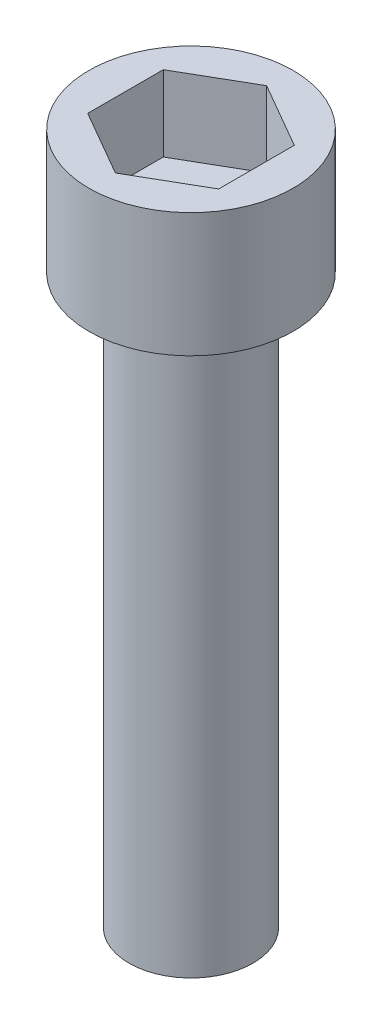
ISO-10303-21;
HEADER;
FILE_DESCRIPTION(('STEP AP214'),'2;1');
FILE_NAME('part.step','',(''),(''),'','','');
FILE_SCHEMA(('AUTOMOTIVE_DESIGN { 1 0 10303 214 1 1 1 1 }'));
ENDSEC;
DATA;
#1=APPLICATION_CONTEXT('core data for automotive mechanical design processes');
#2=APPLICATION_PROTOCOL_DEFINITION('international standard','automotive_design',2000,#1);
#3=PRODUCT_CONTEXT('',#1,'mechanical');
#4=PRODUCT('Part','Part','',(#3));
#5=PRODUCT_RELATED_PRODUCT_CATEGORY('part','',(#4));
#6=PRODUCT_DEFINITION_FORMATION('','',#4);
#7=PRODUCT_DEFINITION_CONTEXT('part definition',#1,'design');
#8=PRODUCT_DEFINITION('design','',#6,#7);
#9=PRODUCT_DEFINITION_SHAPE('','',#8);
#10=(LENGTH_UNIT() NAMED_UNIT(*) SI_UNIT(.MILLI.,.METRE.));
#11=(NAMED_UNIT(*) PLANE_ANGLE_UNIT() SI_UNIT($,.RADIAN.));
#12=(NAMED_UNIT(*) SI_UNIT($,.STERADIAN.) SOLID_ANGLE_UNIT());
#13=UNCERTAINTY_MEASURE_WITH_UNIT(LENGTH_MEASURE(1.E-05),#10,'distance_accuracy_value','');
#14=(GEOMETRIC_REPRESENTATION_CONTEXT(3) GLOBAL_UNCERTAINTY_ASSIGNED_CONTEXT((#13)) GLOBAL_UNIT_ASSIGNED_CONTEXT((#10,
#11,#12)) REPRESENTATION_CONTEXT('',''));
#15=CARTESIAN_POINT('',(0.,0.,0.));
#16=DIRECTION('',(0.,0.,1.));
#17=DIRECTION('',(1.,0.,0.));
#18=AXIS2_PLACEMENT_3D('',#15,#16,#17);
#19=CARTESIAN_POINT('',(-2.08279999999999,-23.2156,0.));
#20=DIRECTION('',(0.,-1.,0.));
#21=DIRECTION('',(0.,0.,-1.));
#22=AXIS2_PLACEMENT_3D('',#19,#20,#21);
#23=PLANE('',#22);
#24=CARTESIAN_POINT('',(0.,-23.2156,0.));
#25=DIRECTION('',(0.,1.,0.));
#26=DIRECTION('',(0.,0.,1.));
#27=AXIS2_PLACEMENT_3D('',#24,#25,#26);
#28=CIRCLE('',#27,2.08279999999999);
#29=CARTESIAN_POINT('',(0.,-23.2156,2.08279999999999));
#30=VERTEX_POINT('',#29);
#31=EDGE_CURVE('E11',#30,#30,#28,.T.);
#32=ORIENTED_EDGE('',*,*,#31,.F.);
#33=EDGE_LOOP('',(#32));
#34=FACE_BOUND('',#33,.T.);
#35=ADVANCED_FACE('F32',(#34),#23,.T.);
#36=CARTESIAN_POINT('',(0.,66.04,0.));
#37=DIRECTION('',(0.,1.,0.));
#38=DIRECTION('',(0.,0.,1.));
#39=AXIS2_PLACEMENT_3D('',#36,#37,#38);
#40=CYLINDRICAL_SURFACE('',#39,2.08279999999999);
#41=ORIENTED_EDGE('',*,*,#31,.T.);
#42=EDGE_LOOP('',(#41));
#43=FACE_BOUND('',#42,.T.);
#44=CARTESIAN_POINT('',(0.,-4.1656,0.));
#45=DIRECTION('',(0.,1.,0.));
#46=DIRECTION('',(0.,0.,1.));
#47=AXIS2_PLACEMENT_3D('',#44,#45,#46);
#48=CIRCLE('',#47,2.08279999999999);
#49=CARTESIAN_POINT('',(0.,-4.1656,2.08279999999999));
#50=VERTEX_POINT('',#49);
#51=EDGE_CURVE('E39',#50,#50,#48,.T.);
#52=ORIENTED_EDGE('',*,*,#51,.F.);
#53=EDGE_LOOP('',(#52));
#54=FACE_BOUND('',#53,.T.);
#55=ADVANCED_FACE('F151',(#43,#54),#40,.T.);
#56=CARTESIAN_POINT('',(-3.42899999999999,-4.1656,0.));
#57=DIRECTION('',(0.,-1.,0.));
#58=DIRECTION('',(0.,0.,-1.));
#59=AXIS2_PLACEMENT_3D('',#56,#57,#58);
#60=PLANE('',#59);
#61=ORIENTED_EDGE('',*,*,#51,.T.);
#62=EDGE_LOOP('',(#61));
#63=FACE_BOUND('',#62,.T.);
#64=CARTESIAN_POINT('',(0.,-4.1656,0.));
#65=DIRECTION('',(0.,1.,0.));
#66=DIRECTION('',(0.,0.,1.));
#67=AXIS2_PLACEMENT_3D('',#64,#65,#66);
#68=CIRCLE('',#67,3.42899999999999);
#69=CARTESIAN_POINT('',(0.,-4.1656,3.42899999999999));
#70=VERTEX_POINT('',#69);
#71=EDGE_CURVE('E143',#70,#70,#68,.T.);
#72=ORIENTED_EDGE('',*,*,#71,.F.);
#73=EDGE_LOOP('',(#72));
#74=FACE_BOUND('',#73,.T.);
#75=ADVANCED_FACE('F148',(#63,#74),#60,.T.);
#76=CARTESIAN_POINT('',(0.,66.04,0.));
#77=DIRECTION('',(0.,1.,0.));
#78=DIRECTION('',(0.,0.,1.));
#79=AXIS2_PLACEMENT_3D('',#76,#77,#78);
#80=CYLINDRICAL_SURFACE('',#79,3.42899999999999);
#81=ORIENTED_EDGE('',*,*,#71,.T.);
#82=EDGE_LOOP('',(#81));
#83=FACE_BOUND('',#82,.T.);
#84=CARTESIAN_POINT('',(0.,0.,0.));
#85=DIRECTION('',(0.,1.,0.));
#86=DIRECTION('',(0.,0.,1.));
#87=AXIS2_PLACEMENT_3D('',#84,#85,#86);
#88=CIRCLE('',#87,3.42899999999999);
#89=CARTESIAN_POINT('',(0.,0.,3.42899999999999));
#90=VERTEX_POINT('',#89);
#91=EDGE_CURVE('E134',#90,#90,#88,.T.);
#92=ORIENTED_EDGE('',*,*,#91,.F.);
#93=EDGE_LOOP('',(#92));
#94=FACE_BOUND('',#93,.T.);
#95=ADVANCED_FACE('F158',(#83,#94),#80,.T.);
#96=CARTESIAN_POINT('',(0.,0.,0.));
#97=DIRECTION('',(0.,1.,0.));
#98=DIRECTION('',(0.,0.,1.));
#99=AXIS2_PLACEMENT_3D('',#96,#97,#98);
#100=PLANE('',#99);
#101=DIRECTION('',(-0.866025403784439,0.,-0.5));
#102=VECTOR('',#101,1.);
#103=CARTESIAN_POINT('',(2.19970452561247,0.,-1.27));
#104=LINE('',#103,#102);
#105=CARTESIAN_POINT('',(2.19970452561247,0.,-1.27));
#106=VERTEX_POINT('',#105);
#107=CARTESIAN_POINT('',(0.,0.,-2.54));
#108=VERTEX_POINT('',#107);
#109=EDGE_CURVE('E46',#106,#108,#104,.T.);
#110=ORIENTED_EDGE('',*,*,#109,.F.);
#111=DIRECTION('',(0.,0.,-1.));
#112=VECTOR('',#111,1.);
#113=CARTESIAN_POINT('',(2.19970452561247,0.,1.27));
#114=LINE('',#113,#112);
#115=CARTESIAN_POINT('',(2.19970452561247,0.,1.27));
#116=VERTEX_POINT('',#115);
#117=EDGE_CURVE('E116',#116,#106,#114,.T.);
#118=ORIENTED_EDGE('',*,*,#117,.F.);
#119=DIRECTION('',(0.866025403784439,0.,-0.5));
#120=VECTOR('',#119,1.);
#121=CARTESIAN_POINT('',(0.,0.,2.54));
#122=LINE('',#121,#120);
#123=CARTESIAN_POINT('',(0.,0.,2.54));
#124=VERTEX_POINT('',#123);
#125=EDGE_CURVE('E110',#124,#116,#122,.T.);
#126=ORIENTED_EDGE('',*,*,#125,.F.);
#127=DIRECTION('',(0.866025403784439,0.,0.5));
#128=VECTOR('',#127,1.);
#129=CARTESIAN_POINT('',(-2.19970452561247,0.,1.27));
#130=LINE('',#129,#128);
#131=CARTESIAN_POINT('',(-2.19970452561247,0.,1.27));
#132=VERTEX_POINT('',#131);
#133=EDGE_CURVE('E108',#132,#124,#130,.T.);
#134=ORIENTED_EDGE('',*,*,#133,.F.);
#135=DIRECTION('',(0.,0.,1.));
#136=VECTOR('',#135,1.);
#137=CARTESIAN_POINT('',(-2.19970452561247,0.,-1.27));
#138=LINE('',#137,#136);
#139=CARTESIAN_POINT('',(-2.19970452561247,0.,-1.27));
#140=VERTEX_POINT('',#139);
#141=EDGE_CURVE('E89',#140,#132,#138,.T.);
#142=ORIENTED_EDGE('',*,*,#141,.F.);
#143=DIRECTION('',(-0.866025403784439,0.,0.5));
#144=VECTOR('',#143,1.);
#145=CARTESIAN_POINT('',(0.,0.,-2.54));
#146=LINE('',#145,#144);
#147=EDGE_CURVE('E100',#108,#140,#146,.T.);
#148=ORIENTED_EDGE('',*,*,#147,.F.);
#149=EDGE_LOOP('',(#110,#118,#126,#134,#142,#148));
#150=FACE_BOUND('',#149,.T.);
#151=ORIENTED_EDGE('',*,*,#91,.T.);
#152=EDGE_LOOP('',(#151));
#153=FACE_BOUND('',#152,.T.);
#154=ADVANCED_FACE('F104',(#150,#153),#100,.T.);
#155=CARTESIAN_POINT('',(2.19970452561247,-2.54,-1.27));
#156=DIRECTION('',(0.5,0.,-0.866025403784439));
#157=DIRECTION('',(-0.866025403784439,0.,-0.5));
#158=AXIS2_PLACEMENT_3D('',#155,#156,#157);
#159=PLANE('',#158);
#160=ORIENTED_EDGE('',*,*,#109,.T.);
#161=DIRECTION('',(0.,1.,0.));
#162=VECTOR('',#161,1.);
#163=CARTESIAN_POINT('',(0.,-2.54,-2.54));
#164=LINE('',#163,#162);
#165=CARTESIAN_POINT('',(0.,-2.54,-2.54));
#166=VERTEX_POINT('',#165);
#167=EDGE_CURVE('E97',#166,#108,#164,.T.);
#168=ORIENTED_EDGE('',*,*,#167,.F.);
#169=DIRECTION('',(-0.866025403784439,0.,-0.5));
#170=VECTOR('',#169,1.);
#171=CARTESIAN_POINT('',(2.19970452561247,-2.54,-1.27));
#172=LINE('',#171,#170);
#173=CARTESIAN_POINT('',(2.19970452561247,-2.54,-1.27));
#174=VERTEX_POINT('',#173);
#175=EDGE_CURVE('E118',#174,#166,#172,.T.);
#176=ORIENTED_EDGE('',*,*,#175,.F.);
#177=DIRECTION('',(0.,1.,0.));
#178=VECTOR('',#177,1.);
#179=CARTESIAN_POINT('',(2.19970452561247,-2.54,-1.27));
#180=LINE('',#179,#178);
#181=EDGE_CURVE('E53',#174,#106,#180,.T.);
#182=ORIENTED_EDGE('',*,*,#181,.T.);
#183=EDGE_LOOP('',(#160,#168,#176,#182));
#184=FACE_BOUND('',#183,.T.);
#185=ADVANCED_FACE('F167',(#184),#159,.F.);
#186=CARTESIAN_POINT('',(2.19970452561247,-2.54,1.27));
#187=DIRECTION('',(1.,0.,0.));
#188=DIRECTION('',(0.,0.,-1.));
#189=AXIS2_PLACEMENT_3D('',#186,#187,#188);
#190=PLANE('',#189);
#191=ORIENTED_EDGE('',*,*,#117,.T.);
#192=ORIENTED_EDGE('',*,*,#181,.F.);
#193=DIRECTION('',(0.,0.,-1.));
#194=VECTOR('',#193,1.);
#195=CARTESIAN_POINT('',(2.19970452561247,-2.54,1.27));
#196=LINE('',#195,#194);
#197=CARTESIAN_POINT('',(2.19970452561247,-2.54,1.27));
#198=VERTEX_POINT('',#197);
#199=EDGE_CURVE('E130',#198,#174,#196,.T.);
#200=ORIENTED_EDGE('',*,*,#199,.F.);
#201=DIRECTION('',(0.,1.,0.));
#202=VECTOR('',#201,1.);
#203=CARTESIAN_POINT('',(2.19970452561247,-2.54,1.27));
#204=LINE('',#203,#202);
#205=EDGE_CURVE('E135',#198,#116,#204,.T.);
#206=ORIENTED_EDGE('',*,*,#205,.T.);
#207=EDGE_LOOP('',(#191,#192,#200,#206));
#208=FACE_BOUND('',#207,.T.);
#209=ADVANCED_FACE('F170',(#208),#190,.F.);
#210=CARTESIAN_POINT('',(0.,-2.54,2.54));
#211=DIRECTION('',(0.5,0.,0.866025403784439));
#212=DIRECTION('',(0.866025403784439,0.,-0.5));
#213=AXIS2_PLACEMENT_3D('',#210,#211,#212);
#214=PLANE('',#213);
#215=ORIENTED_EDGE('',*,*,#125,.T.);
#216=ORIENTED_EDGE('',*,*,#205,.F.);
#217=DIRECTION('',(0.866025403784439,0.,-0.5));
#218=VECTOR('',#217,1.);
#219=CARTESIAN_POINT('',(0.,-2.54,2.54));
#220=LINE('',#219,#218);
#221=CARTESIAN_POINT('',(0.,-2.54,2.54));
#222=VERTEX_POINT('',#221);
#223=EDGE_CURVE('E127',#222,#198,#220,.T.);
#224=ORIENTED_EDGE('',*,*,#223,.F.);
#225=DIRECTION('',(0.,1.,0.));
#226=VECTOR('',#225,1.);
#227=CARTESIAN_POINT('',(0.,-2.54,2.54));
#228=LINE('',#227,#226);
#229=EDGE_CURVE('E137',#222,#124,#228,.T.);
#230=ORIENTED_EDGE('',*,*,#229,.T.);
#231=EDGE_LOOP('',(#215,#216,#224,#230));
#232=FACE_BOUND('',#231,.T.);
#233=ADVANCED_FACE('F179',(#232),#214,.F.);
#234=CARTESIAN_POINT('',(-2.19970452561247,-2.54,1.27));
#235=DIRECTION('',(-0.5,0.,0.866025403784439));
#236=DIRECTION('',(0.866025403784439,0.,0.5));
#237=AXIS2_PLACEMENT_3D('',#234,#235,#236);
#238=PLANE('',#237);
#239=ORIENTED_EDGE('',*,*,#133,.T.);
#240=ORIENTED_EDGE('',*,*,#229,.F.);
#241=DIRECTION('',(0.866025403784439,0.,0.5));
#242=VECTOR('',#241,1.);
#243=CARTESIAN_POINT('',(-2.19970452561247,-2.54,1.27));
#244=LINE('',#243,#242);
#245=CARTESIAN_POINT('',(-2.19970452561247,-2.54,1.27));
#246=VERTEX_POINT('',#245);
#247=EDGE_CURVE('E124',#246,#222,#244,.T.);
#248=ORIENTED_EDGE('',*,*,#247,.F.);
#249=DIRECTION('',(0.,1.,0.));
#250=VECTOR('',#249,1.);
#251=CARTESIAN_POINT('',(-2.19970452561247,-2.54,1.27));
#252=LINE('',#251,#250);
#253=EDGE_CURVE('E96',#246,#132,#252,.T.);
#254=ORIENTED_EDGE('',*,*,#253,.T.);
#255=EDGE_LOOP('',(#239,#240,#248,#254));
#256=FACE_BOUND('',#255,.T.);
#257=ADVANCED_FACE('F176',(#256),#238,.F.);
#258=CARTESIAN_POINT('',(-2.19970452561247,-2.54,-1.27));
#259=DIRECTION('',(-1.,0.,0.));
#260=DIRECTION('',(0.,0.,1.));
#261=AXIS2_PLACEMENT_3D('',#258,#259,#260);
#262=PLANE('',#261);
#263=ORIENTED_EDGE('',*,*,#141,.T.);
#264=ORIENTED_EDGE('',*,*,#253,.F.);
#265=DIRECTION('',(0.,0.,1.));
#266=VECTOR('',#265,1.);
#267=CARTESIAN_POINT('',(-2.19970452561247,-2.54,-1.27));
#268=LINE('',#267,#266);
#269=CARTESIAN_POINT('',(-2.19970452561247,-2.54,-1.27));
#270=VERTEX_POINT('',#269);
#271=EDGE_CURVE('E92',#270,#246,#268,.T.);
#272=ORIENTED_EDGE('',*,*,#271,.F.);
#273=DIRECTION('',(0.,1.,0.));
#274=VECTOR('',#273,1.);
#275=CARTESIAN_POINT('',(-2.19970452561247,-2.54,-1.27));
#276=LINE('',#275,#274);
#277=EDGE_CURVE('E85',#270,#140,#276,.T.);
#278=ORIENTED_EDGE('',*,*,#277,.T.);
#279=EDGE_LOOP('',(#263,#264,#272,#278));
#280=FACE_BOUND('',#279,.T.);
#281=ADVANCED_FACE('F87',(#280),#262,.F.);
#282=CARTESIAN_POINT('',(0.,-2.54,-2.54));
#283=DIRECTION('',(-0.5,0.,-0.866025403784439));
#284=DIRECTION('',(-0.866025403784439,0.,0.5));
#285=AXIS2_PLACEMENT_3D('',#282,#283,#284);
#286=PLANE('',#285);
#287=ORIENTED_EDGE('',*,*,#147,.T.);
#288=ORIENTED_EDGE('',*,*,#277,.F.);
#289=DIRECTION('',(-0.866025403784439,0.,0.5));
#290=VECTOR('',#289,1.);
#291=CARTESIAN_POINT('',(0.,-2.54,-2.54));
#292=LINE('',#291,#290);
#293=EDGE_CURVE('E121',#166,#270,#292,.T.);
#294=ORIENTED_EDGE('',*,*,#293,.F.);
#295=ORIENTED_EDGE('',*,*,#167,.T.);
#296=EDGE_LOOP('',(#287,#288,#294,#295));
#297=FACE_BOUND('',#296,.T.);
#298=ADVANCED_FACE('F101',(#297),#286,.F.);
#299=CARTESIAN_POINT('',(-2.19970452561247,-2.54,-3.81));
#300=DIRECTION('',(0.,1.,0.));
#301=DIRECTION('',(0.,0.,1.));
#302=AXIS2_PLACEMENT_3D('',#299,#300,#301);
#303=PLANE('',#302);
#304=ORIENTED_EDGE('',*,*,#175,.T.);
#305=ORIENTED_EDGE('',*,*,#293,.T.);
#306=ORIENTED_EDGE('',*,*,#271,.T.);
#307=ORIENTED_EDGE('',*,*,#247,.T.);
#308=ORIENTED_EDGE('',*,*,#223,.T.);
#309=ORIENTED_EDGE('',*,*,#199,.T.);
#310=EDGE_LOOP('',(#304,#305,#306,#307,#308,#309));
#311=FACE_BOUND('',#310,.T.);
#312=ADVANCED_FACE('F173',(#311),#303,.T.);
#313=CLOSED_SHELL('',(#35,#55,#75,#95,#154,#185,#209,#233,#257,#281,#298,#312));
#314=MANIFOLD_SOLID_BREP('B2',#313);
#315=ADVANCED_BREP_SHAPE_REPRESENTATION('',(#18,#314),#14);
#316=SHAPE_DEFINITION_REPRESENTATION(#9,#315);
ENDSEC;
END-ISO-10303-21;
